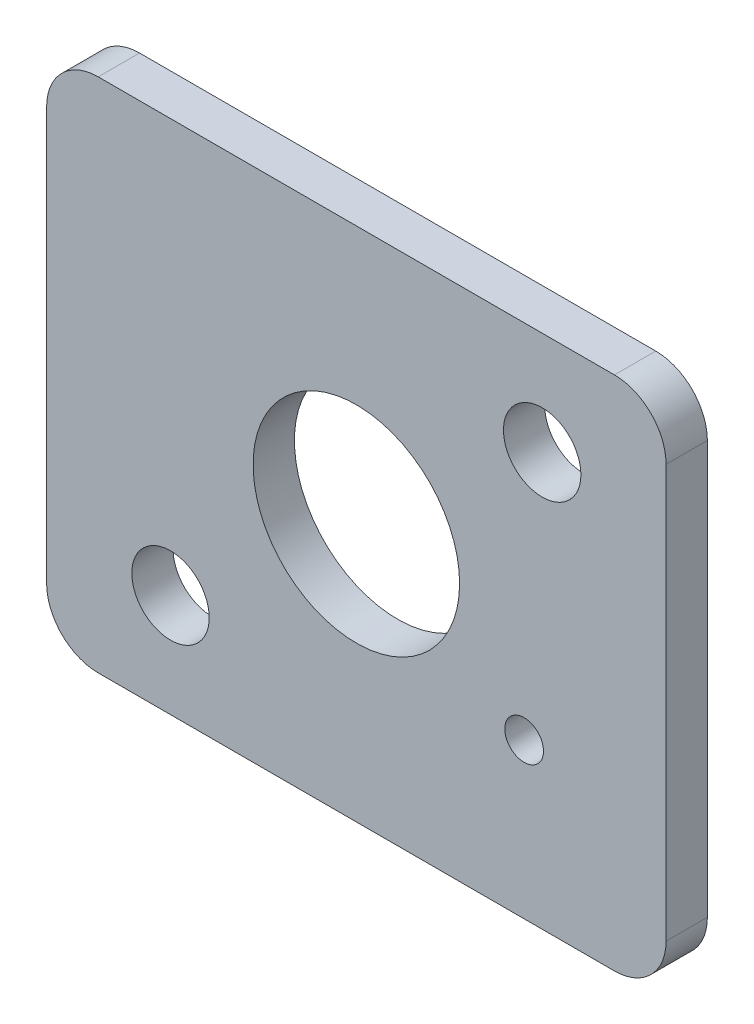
ISO-10303-21;
HEADER;
FILE_DESCRIPTION(('STEP AP214'),'2;1');
FILE_NAME('part.step','',(''),(''),'','','');
FILE_SCHEMA(('AUTOMOTIVE_DESIGN { 1 0 10303 214 1 1 1 1 }'));
ENDSEC;
DATA;
#1=APPLICATION_CONTEXT('core data for automotive mechanical design processes');
#2=APPLICATION_PROTOCOL_DEFINITION('international standard','automotive_design',2000,#1);
#3=PRODUCT_CONTEXT('',#1,'mechanical');
#4=PRODUCT('Part','Part','',(#3));
#5=PRODUCT_RELATED_PRODUCT_CATEGORY('part','',(#4));
#6=PRODUCT_DEFINITION_FORMATION('','',#4);
#7=PRODUCT_DEFINITION_CONTEXT('part definition',#1,'design');
#8=PRODUCT_DEFINITION('design','',#6,#7);
#9=PRODUCT_DEFINITION_SHAPE('','',#8);
#10=(LENGTH_UNIT() NAMED_UNIT(*) SI_UNIT(.MILLI.,.METRE.));
#11=(NAMED_UNIT(*) PLANE_ANGLE_UNIT() SI_UNIT($,.RADIAN.));
#12=(NAMED_UNIT(*) SI_UNIT($,.STERADIAN.) SOLID_ANGLE_UNIT());
#13=UNCERTAINTY_MEASURE_WITH_UNIT(LENGTH_MEASURE(1.E-05),#10,'distance_accuracy_value','');
#14=(GEOMETRIC_REPRESENTATION_CONTEXT(3) GLOBAL_UNCERTAINTY_ASSIGNED_CONTEXT((#13)) GLOBAL_UNIT_ASSIGNED_CONTEXT((#10,
#11,#12)) REPRESENTATION_CONTEXT('',''));
#15=CARTESIAN_POINT('',(0.,0.,0.));
#16=DIRECTION('',(0.,0.,1.));
#17=DIRECTION('',(1.,0.,0.));
#18=AXIS2_PLACEMENT_3D('',#15,#16,#17);
#19=CARTESIAN_POINT('',(6.,-5.,0.8));
#20=DIRECTION('',(-1.,0.,0.));
#21=DIRECTION('',(0.,0.,1.));
#22=AXIS2_PLACEMENT_3D('',#19,#20,#21);
#23=PLANE('',#22);
#24=DIRECTION('',(0.,1.,0.));
#25=VECTOR('',#24,1.);
#26=CARTESIAN_POINT('',(6.,-5.,0.8));
#27=LINE('',#26,#25);
#28=CARTESIAN_POINT('',(6.,-4.,0.8));
#29=VERTEX_POINT('',#28);
#30=CARTESIAN_POINT('',(6.,4.,0.8));
#31=VERTEX_POINT('',#30);
#32=EDGE_CURVE('E119',#29,#31,#27,.T.);
#33=ORIENTED_EDGE('',*,*,#32,.F.);
#34=DIRECTION('',(0.,0.,-1.));
#35=VECTOR('',#34,1.);
#36=CARTESIAN_POINT('',(6.,-4.,0.8));
#37=LINE('',#36,#35);
#38=CARTESIAN_POINT('',(6.,-4.,0.));
#39=VERTEX_POINT('',#38);
#40=EDGE_CURVE('E104',#29,#39,#37,.T.);
#41=ORIENTED_EDGE('',*,*,#40,.T.);
#42=DIRECTION('',(0.,1.,0.));
#43=VECTOR('',#42,1.);
#44=CARTESIAN_POINT('',(6.,-5.,0.));
#45=LINE('',#44,#43);
#46=CARTESIAN_POINT('',(6.,4.,0.));
#47=VERTEX_POINT('',#46);
#48=EDGE_CURVE('E116',#39,#47,#45,.T.);
#49=ORIENTED_EDGE('',*,*,#48,.T.);
#50=DIRECTION('',(0.,0.,-1.));
#51=VECTOR('',#50,1.);
#52=CARTESIAN_POINT('',(6.,4.,0.8));
#53=LINE('',#52,#51);
#54=EDGE_CURVE('E121',#47,#31,#53,.F.);
#55=ORIENTED_EDGE('',*,*,#54,.T.);
#56=EDGE_LOOP('',(#33,#41,#49,#55));
#57=FACE_BOUND('',#56,.T.);
#58=ADVANCED_FACE('F34',(#57),#23,.F.);
#59=CARTESIAN_POINT('',(-6.,5.,0.8));
#60=DIRECTION('',(0.,-1.,0.));
#61=DIRECTION('',(0.,0.,-1.));
#62=AXIS2_PLACEMENT_3D('',#59,#60,#61);
#63=PLANE('',#62);
#64=DIRECTION('',(-1.,0.,0.));
#65=VECTOR('',#64,1.);
#66=CARTESIAN_POINT('',(-6.,5.,0.));
#67=LINE('',#66,#65);
#68=CARTESIAN_POINT('',(5.,5.,0.));
#69=VERTEX_POINT('',#68);
#70=CARTESIAN_POINT('',(-5.,5.,0.));
#71=VERTEX_POINT('',#70);
#72=EDGE_CURVE('E125',#69,#71,#67,.T.);
#73=ORIENTED_EDGE('',*,*,#72,.T.);
#74=DIRECTION('',(0.,0.,-1.));
#75=VECTOR('',#74,1.);
#76=CARTESIAN_POINT('',(-5.,5.,0.8));
#77=LINE('',#76,#75);
#78=CARTESIAN_POINT('',(-5.,5.,0.8));
#79=VERTEX_POINT('',#78);
#80=EDGE_CURVE('E11',#71,#79,#77,.F.);
#81=ORIENTED_EDGE('',*,*,#80,.T.);
#82=DIRECTION('',(-1.,0.,0.));
#83=VECTOR('',#82,1.);
#84=CARTESIAN_POINT('',(-6.,5.,0.8));
#85=LINE('',#84,#83);
#86=CARTESIAN_POINT('',(5.,5.,0.8));
#87=VERTEX_POINT('',#86);
#88=EDGE_CURVE('E165',#87,#79,#85,.T.);
#89=ORIENTED_EDGE('',*,*,#88,.F.);
#90=DIRECTION('',(0.,0.,-1.));
#91=VECTOR('',#90,1.);
#92=CARTESIAN_POINT('',(5.,5.,0.8));
#93=LINE('',#92,#91);
#94=EDGE_CURVE('E42',#87,#69,#93,.T.);
#95=ORIENTED_EDGE('',*,*,#94,.T.);
#96=EDGE_LOOP('',(#73,#81,#89,#95));
#97=FACE_BOUND('',#96,.T.);
#98=ADVANCED_FACE('F163',(#97),#63,.F.);
#99=CARTESIAN_POINT('',(-6.,-5.,0.8));
#100=DIRECTION('',(1.,0.,0.));
#101=DIRECTION('',(0.,0.,-1.));
#102=AXIS2_PLACEMENT_3D('',#99,#100,#101);
#103=PLANE('',#102);
#104=DIRECTION('',(0.,-1.,0.));
#105=VECTOR('',#104,1.);
#106=CARTESIAN_POINT('',(-6.,-5.,0.));
#107=LINE('',#106,#105);
#108=CARTESIAN_POINT('',(-6.,4.,0.));
#109=VERTEX_POINT('',#108);
#110=CARTESIAN_POINT('',(-6.,-4.,0.));
#111=VERTEX_POINT('',#110);
#112=EDGE_CURVE('E129',#109,#111,#107,.T.);
#113=ORIENTED_EDGE('',*,*,#112,.T.);
#114=DIRECTION('',(0.,0.,-1.));
#115=VECTOR('',#114,1.);
#116=CARTESIAN_POINT('',(-6.,-4.,0.8));
#117=LINE('',#116,#115);
#118=CARTESIAN_POINT('',(-6.,-4.,0.8));
#119=VERTEX_POINT('',#118);
#120=EDGE_CURVE('E49',#111,#119,#117,.F.);
#121=ORIENTED_EDGE('',*,*,#120,.T.);
#122=DIRECTION('',(0.,-1.,0.));
#123=VECTOR('',#122,1.);
#124=CARTESIAN_POINT('',(-6.,-5.,0.8));
#125=LINE('',#124,#123);
#126=CARTESIAN_POINT('',(-6.,4.,0.8));
#127=VERTEX_POINT('',#126);
#128=EDGE_CURVE('E173',#127,#119,#125,.T.);
#129=ORIENTED_EDGE('',*,*,#128,.F.);
#130=DIRECTION('',(0.,0.,-1.));
#131=VECTOR('',#130,1.);
#132=CARTESIAN_POINT('',(-6.,4.,0.8));
#133=LINE('',#132,#131);
#134=EDGE_CURVE('E156',#127,#109,#133,.T.);
#135=ORIENTED_EDGE('',*,*,#134,.T.);
#136=EDGE_LOOP('',(#113,#121,#129,#135));
#137=FACE_BOUND('',#136,.T.);
#138=ADVANCED_FACE('F172',(#137),#103,.F.);
#139=CARTESIAN_POINT('',(-6.,-5.,0.8));
#140=DIRECTION('',(0.,1.,0.));
#141=DIRECTION('',(0.,0.,1.));
#142=AXIS2_PLACEMENT_3D('',#139,#140,#141);
#143=PLANE('',#142);
#144=DIRECTION('',(1.,0.,0.));
#145=VECTOR('',#144,1.);
#146=CARTESIAN_POINT('',(-6.,-5.,0.));
#147=LINE('',#146,#145);
#148=CARTESIAN_POINT('',(-5.,-5.,0.));
#149=VERTEX_POINT('',#148);
#150=CARTESIAN_POINT('',(5.,-5.,0.));
#151=VERTEX_POINT('',#150);
#152=EDGE_CURVE('E139',#149,#151,#147,.T.);
#153=ORIENTED_EDGE('',*,*,#152,.T.);
#154=DIRECTION('',(0.,0.,-1.));
#155=VECTOR('',#154,1.);
#156=CARTESIAN_POINT('',(5.,-5.,0.8));
#157=LINE('',#156,#155);
#158=CARTESIAN_POINT('',(5.,-5.,0.8));
#159=VERTEX_POINT('',#158);
#160=EDGE_CURVE('E105',#151,#159,#157,.F.);
#161=ORIENTED_EDGE('',*,*,#160,.T.);
#162=DIRECTION('',(1.,0.,0.));
#163=VECTOR('',#162,1.);
#164=CARTESIAN_POINT('',(-6.,-5.,0.8));
#165=LINE('',#164,#163);
#166=CARTESIAN_POINT('',(-5.,-5.,0.8));
#167=VERTEX_POINT('',#166);
#168=EDGE_CURVE('E135',#167,#159,#165,.T.);
#169=ORIENTED_EDGE('',*,*,#168,.F.);
#170=DIRECTION('',(0.,0.,-1.));
#171=VECTOR('',#170,1.);
#172=CARTESIAN_POINT('',(-5.,-5.,0.8));
#173=LINE('',#172,#171);
#174=EDGE_CURVE('E110',#167,#149,#173,.T.);
#175=ORIENTED_EDGE('',*,*,#174,.T.);
#176=EDGE_LOOP('',(#153,#161,#169,#175));
#177=FACE_BOUND('',#176,.T.);
#178=ADVANCED_FACE('F205',(#177),#143,.F.);
#179=CARTESIAN_POINT('',(0.,0.,0.8));
#180=DIRECTION('',(0.,0.,-1.));
#181=DIRECTION('',(-1.,0.,0.));
#182=AXIS2_PLACEMENT_3D('',#179,#180,#181);
#183=PLANE('',#182);
#184=CARTESIAN_POINT('',(-3.6,-3.,0.8));
#185=DIRECTION('',(0.,0.,1.));
#186=DIRECTION('',(1.,0.,0.));
#187=AXIS2_PLACEMENT_3D('',#184,#185,#186);
#188=CIRCLE('',#187,0.75);
#189=CARTESIAN_POINT('',(-2.84999999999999,-3.,0.8));
#190=VERTEX_POINT('',#189);
#191=EDGE_CURVE('E180',#190,#190,#188,.T.);
#192=ORIENTED_EDGE('',*,*,#191,.F.);
#193=EDGE_LOOP('',(#192));
#194=FACE_BOUND('',#193,.T.);
#195=CARTESIAN_POINT('',(3.6,3.,0.8));
#196=DIRECTION('',(0.,0.,1.));
#197=DIRECTION('',(1.,0.,0.));
#198=AXIS2_PLACEMENT_3D('',#195,#196,#197);
#199=CIRCLE('',#198,0.750000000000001);
#200=CARTESIAN_POINT('',(4.35,3.,0.8));
#201=VERTEX_POINT('',#200);
#202=EDGE_CURVE('E191',#201,#201,#199,.T.);
#203=ORIENTED_EDGE('',*,*,#202,.F.);
#204=EDGE_LOOP('',(#203));
#205=FACE_BOUND('',#204,.T.);
#206=CARTESIAN_POINT('',(3.25,-2.,0.8));
#207=DIRECTION('',(0.,0.,1.));
#208=DIRECTION('',(1.,0.,0.));
#209=AXIS2_PLACEMENT_3D('',#206,#207,#208);
#210=CIRCLE('',#209,0.375);
#211=CARTESIAN_POINT('',(3.625,-2.,0.8));
#212=VERTEX_POINT('',#211);
#213=EDGE_CURVE('E185',#212,#212,#210,.T.);
#214=ORIENTED_EDGE('',*,*,#213,.F.);
#215=EDGE_LOOP('',(#214));
#216=FACE_BOUND('',#215,.T.);
#217=CARTESIAN_POINT('',(0.,0.,0.8));
#218=DIRECTION('',(0.,0.,1.));
#219=DIRECTION('',(1.,0.,0.));
#220=AXIS2_PLACEMENT_3D('',#217,#218,#219);
#221=CIRCLE('',#220,2.);
#222=CARTESIAN_POINT('',(2.,0.,0.8));
#223=VERTEX_POINT('',#222);
#224=EDGE_CURVE('E126',#223,#223,#221,.T.);
#225=ORIENTED_EDGE('',*,*,#224,.F.);
#226=EDGE_LOOP('',(#225));
#227=FACE_BOUND('',#226,.T.);
#228=ORIENTED_EDGE('',*,*,#168,.T.);
#229=CARTESIAN_POINT('',(5.,-4.,0.8));
#230=DIRECTION('',(0.,0.,-1.));
#231=DIRECTION('',(-1.,0.,0.));
#232=AXIS2_PLACEMENT_3D('',#229,#230,#231);
#233=CIRCLE('',#232,1.);
#234=EDGE_CURVE('E154',#159,#29,#233,.F.);
#235=ORIENTED_EDGE('',*,*,#234,.T.);
#236=ORIENTED_EDGE('',*,*,#32,.T.);
#237=CARTESIAN_POINT('',(5.,4.,0.8));
#238=DIRECTION('',(0.,0.,-1.));
#239=DIRECTION('',(-1.,0.,0.));
#240=AXIS2_PLACEMENT_3D('',#237,#238,#239);
#241=CIRCLE('',#240,1.);
#242=EDGE_CURVE('E149',#31,#87,#241,.F.);
#243=ORIENTED_EDGE('',*,*,#242,.T.);
#244=ORIENTED_EDGE('',*,*,#88,.T.);
#245=CARTESIAN_POINT('',(-5.,4.,0.8));
#246=DIRECTION('',(0.,0.,-1.));
#247=DIRECTION('',(-1.,0.,0.));
#248=AXIS2_PLACEMENT_3D('',#245,#246,#247);
#249=CIRCLE('',#248,1.);
#250=EDGE_CURVE('E56',#79,#127,#249,.F.);
#251=ORIENTED_EDGE('',*,*,#250,.T.);
#252=ORIENTED_EDGE('',*,*,#128,.T.);
#253=CARTESIAN_POINT('',(-5.,-4.,0.8));
#254=DIRECTION('',(0.,0.,-1.));
#255=DIRECTION('',(-1.,0.,0.));
#256=AXIS2_PLACEMENT_3D('',#253,#254,#255);
#257=CIRCLE('',#256,1.);
#258=EDGE_CURVE('E152',#119,#167,#257,.F.);
#259=ORIENTED_EDGE('',*,*,#258,.T.);
#260=EDGE_LOOP('',(#228,#235,#236,#243,#244,#251,#252,#259));
#261=FACE_BOUND('',#260,.T.);
#262=ADVANCED_FACE('F202',(#194,#205,#216,#227,#261),#183,.F.);
#263=CARTESIAN_POINT('',(0.,0.,0.));
#264=DIRECTION('',(0.,0.,-1.));
#265=DIRECTION('',(-1.,0.,0.));
#266=AXIS2_PLACEMENT_3D('',#263,#264,#265);
#267=PLANE('',#266);
#268=CARTESIAN_POINT('',(-3.6,-3.,0.));
#269=DIRECTION('',(0.,0.,-1.));
#270=DIRECTION('',(-1.,0.,0.));
#271=AXIS2_PLACEMENT_3D('',#268,#269,#270);
#272=CIRCLE('',#271,0.75);
#273=CARTESIAN_POINT('',(-2.84999999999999,-3.,0.));
#274=VERTEX_POINT('',#273);
#275=EDGE_CURVE('E194',#274,#274,#272,.F.);
#276=ORIENTED_EDGE('',*,*,#275,.T.);
#277=EDGE_LOOP('',(#276));
#278=FACE_BOUND('',#277,.T.);
#279=CARTESIAN_POINT('',(3.6,3.,0.));
#280=DIRECTION('',(0.,0.,-1.));
#281=DIRECTION('',(-1.,0.,0.));
#282=AXIS2_PLACEMENT_3D('',#279,#280,#281);
#283=CIRCLE('',#282,0.750000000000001);
#284=CARTESIAN_POINT('',(4.35,3.,0.));
#285=VERTEX_POINT('',#284);
#286=EDGE_CURVE('E188',#285,#285,#283,.F.);
#287=ORIENTED_EDGE('',*,*,#286,.T.);
#288=EDGE_LOOP('',(#287));
#289=FACE_BOUND('',#288,.T.);
#290=CARTESIAN_POINT('',(3.25,-2.,0.));
#291=DIRECTION('',(0.,0.,-1.));
#292=DIRECTION('',(-1.,0.,0.));
#293=AXIS2_PLACEMENT_3D('',#290,#291,#292);
#294=CIRCLE('',#293,0.375);
#295=CARTESIAN_POINT('',(2.875,-2.,0.));
#296=VERTEX_POINT('',#295);
#297=EDGE_CURVE('E182',#296,#296,#294,.F.);
#298=ORIENTED_EDGE('',*,*,#297,.T.);
#299=EDGE_LOOP('',(#298));
#300=FACE_BOUND('',#299,.T.);
#301=CARTESIAN_POINT('',(0.,0.,0.));
#302=DIRECTION('',(0.,0.,-1.));
#303=DIRECTION('',(-1.,0.,0.));
#304=AXIS2_PLACEMENT_3D('',#301,#302,#303);
#305=CIRCLE('',#304,2.);
#306=CARTESIAN_POINT('',(2.,0.,0.));
#307=VERTEX_POINT('',#306);
#308=EDGE_CURVE('E132',#307,#307,#305,.F.);
#309=ORIENTED_EDGE('',*,*,#308,.T.);
#310=EDGE_LOOP('',(#309));
#311=FACE_BOUND('',#310,.T.);
#312=ORIENTED_EDGE('',*,*,#48,.F.);
#313=CARTESIAN_POINT('',(5.,-4.,0.));
#314=DIRECTION('',(0.,0.,-1.));
#315=DIRECTION('',(-1.,0.,0.));
#316=AXIS2_PLACEMENT_3D('',#313,#314,#315);
#317=CIRCLE('',#316,1.);
#318=EDGE_CURVE('E100',#39,#151,#317,.T.);
#319=ORIENTED_EDGE('',*,*,#318,.T.);
#320=ORIENTED_EDGE('',*,*,#152,.F.);
#321=CARTESIAN_POINT('',(-5.,-4.,0.));
#322=DIRECTION('',(0.,0.,-1.));
#323=DIRECTION('',(-1.,0.,0.));
#324=AXIS2_PLACEMENT_3D('',#321,#322,#323);
#325=CIRCLE('',#324,1.);
#326=EDGE_CURVE('E111',#149,#111,#325,.T.);
#327=ORIENTED_EDGE('',*,*,#326,.T.);
#328=ORIENTED_EDGE('',*,*,#112,.F.);
#329=CARTESIAN_POINT('',(-5.,4.,0.));
#330=DIRECTION('',(0.,0.,-1.));
#331=DIRECTION('',(-1.,0.,0.));
#332=AXIS2_PLACEMENT_3D('',#329,#330,#331);
#333=CIRCLE('',#332,1.);
#334=EDGE_CURVE('E143',#109,#71,#333,.T.);
#335=ORIENTED_EDGE('',*,*,#334,.T.);
#336=ORIENTED_EDGE('',*,*,#72,.F.);
#337=CARTESIAN_POINT('',(5.,4.,0.));
#338=DIRECTION('',(0.,0.,-1.));
#339=DIRECTION('',(-1.,0.,0.));
#340=AXIS2_PLACEMENT_3D('',#337,#338,#339);
#341=CIRCLE('',#340,1.);
#342=EDGE_CURVE('E120',#69,#47,#341,.T.);
#343=ORIENTED_EDGE('',*,*,#342,.T.);
#344=EDGE_LOOP('',(#312,#319,#320,#327,#328,#335,#336,#343));
#345=FACE_BOUND('',#344,.T.);
#346=ADVANCED_FACE('F123',(#278,#289,#300,#311,#345),#267,.T.);
#347=CARTESIAN_POINT('',(0.,0.,-0.00100000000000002));
#348=DIRECTION('',(0.,0.,1.));
#349=DIRECTION('',(1.,0.,0.));
#350=AXIS2_PLACEMENT_3D('',#347,#348,#349);
#351=CYLINDRICAL_SURFACE('',#350,2.);
#352=CARTESIAN_POINT('',(2.,0.,0.));
#353=CARTESIAN_POINT('',(2.,0.,0.00833333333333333));
#354=CARTESIAN_POINT('',(2.,0.,0.0166666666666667));
#355=CARTESIAN_POINT('',(2.,0.,0.0333333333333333));
#356=CARTESIAN_POINT('',(2.,0.,0.0416666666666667));
#357=CARTESIAN_POINT('',(2.,0.,0.0583333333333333));
#358=CARTESIAN_POINT('',(2.,0.,0.0666666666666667));
#359=CARTESIAN_POINT('',(2.,0.,0.0833333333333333));
#360=CARTESIAN_POINT('',(2.,0.,0.0916666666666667));
#361=CARTESIAN_POINT('',(2.,0.,0.108333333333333));
#362=CARTESIAN_POINT('',(2.,0.,0.116666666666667));
#363=CARTESIAN_POINT('',(2.,0.,0.133333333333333));
#364=CARTESIAN_POINT('',(2.,0.,0.141666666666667));
#365=CARTESIAN_POINT('',(2.,0.,0.158333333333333));
#366=CARTESIAN_POINT('',(2.,0.,0.166666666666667));
#367=CARTESIAN_POINT('',(2.,0.,0.183333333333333));
#368=CARTESIAN_POINT('',(2.,0.,0.191666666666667));
#369=CARTESIAN_POINT('',(2.,0.,0.208333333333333));
#370=CARTESIAN_POINT('',(2.,0.,0.216666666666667));
#371=CARTESIAN_POINT('',(2.,0.,0.233333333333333));
#372=CARTESIAN_POINT('',(2.,0.,0.241666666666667));
#373=CARTESIAN_POINT('',(2.,0.,0.258333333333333));
#374=CARTESIAN_POINT('',(2.,0.,0.266666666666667));
#375=CARTESIAN_POINT('',(2.,0.,0.283333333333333));
#376=CARTESIAN_POINT('',(2.,0.,0.291666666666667));
#377=CARTESIAN_POINT('',(2.,0.,0.308333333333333));
#378=CARTESIAN_POINT('',(2.,0.,0.316666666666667));
#379=CARTESIAN_POINT('',(2.,0.,0.333333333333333));
#380=CARTESIAN_POINT('',(2.,0.,0.341666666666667));
#381=CARTESIAN_POINT('',(2.,0.,0.358333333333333));
#382=CARTESIAN_POINT('',(2.,0.,0.366666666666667));
#383=CARTESIAN_POINT('',(2.,0.,0.383333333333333));
#384=CARTESIAN_POINT('',(2.,0.,0.391666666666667));
#385=CARTESIAN_POINT('',(2.,0.,0.408333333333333));
#386=CARTESIAN_POINT('',(2.,0.,0.416666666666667));
#387=CARTESIAN_POINT('',(2.,0.,0.433333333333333));
#388=CARTESIAN_POINT('',(2.,0.,0.441666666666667));
#389=CARTESIAN_POINT('',(2.,0.,0.458333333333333));
#390=CARTESIAN_POINT('',(2.,0.,0.466666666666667));
#391=CARTESIAN_POINT('',(2.,0.,0.483333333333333));
#392=CARTESIAN_POINT('',(2.,0.,0.491666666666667));
#393=CARTESIAN_POINT('',(2.,0.,0.508333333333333));
#394=CARTESIAN_POINT('',(2.,0.,0.516666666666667));
#395=CARTESIAN_POINT('',(2.,0.,0.533333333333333));
#396=CARTESIAN_POINT('',(2.,0.,0.541666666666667));
#397=CARTESIAN_POINT('',(2.,0.,0.558333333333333));
#398=CARTESIAN_POINT('',(2.,0.,0.566666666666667));
#399=CARTESIAN_POINT('',(2.,0.,0.583333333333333));
#400=CARTESIAN_POINT('',(2.,0.,0.591666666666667));
#401=CARTESIAN_POINT('',(2.,0.,0.608333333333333));
#402=CARTESIAN_POINT('',(2.,0.,0.616666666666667));
#403=CARTESIAN_POINT('',(2.,0.,0.633333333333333));
#404=CARTESIAN_POINT('',(2.,0.,0.641666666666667));
#405=CARTESIAN_POINT('',(2.,0.,0.658333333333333));
#406=CARTESIAN_POINT('',(2.,0.,0.666666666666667));
#407=CARTESIAN_POINT('',(2.,0.,0.683333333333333));
#408=CARTESIAN_POINT('',(2.,0.,0.691666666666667));
#409=CARTESIAN_POINT('',(2.,0.,0.708333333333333));
#410=CARTESIAN_POINT('',(2.,0.,0.716666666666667));
#411=CARTESIAN_POINT('',(2.,0.,0.733333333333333));
#412=CARTESIAN_POINT('',(2.,0.,0.741666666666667));
#413=CARTESIAN_POINT('',(2.,0.,0.758333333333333));
#414=CARTESIAN_POINT('',(2.,0.,0.766666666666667));
#415=CARTESIAN_POINT('',(2.,0.,0.783333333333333));
#416=CARTESIAN_POINT('',(2.,0.,0.791666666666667));
#417=CARTESIAN_POINT('',(2.,0.,0.8));
#418=B_SPLINE_CURVE_WITH_KNOTS('',3,(#352,#353,#354,#355,#356,#357,#358,#359,#360,#361,#362,
#363,#364,#365,#366,#367,#368,#369,#370,#371,#372,#373,#374,#375,#376,#377,#378,#379,#380,#381,
#382,#383,#384,#385,#386,#387,#388,#389,#390,#391,#392,#393,#394,#395,#396,#397,#398,#399,#400,
#401,#402,#403,#404,#405,#406,#407,#408,#409,#410,#411,#412,#413,#414,#415,#416,#417),
.UNSPECIFIED.,.F.,.F.,(4,2,2,2,2,2,2,2,2,2,2,2,2,2,2,2,2,2,2,2,2,2,2,2,2,2,2,2,2,2,2,2,4),(0.,
0.025,0.05,0.075,0.1,0.125,0.15,0.175,0.2,0.225,0.25,0.275,0.3,0.325,0.35,0.375,0.4,0.425,0.45,
0.475,0.5,0.525,0.55,0.575,0.6,0.625,0.65,0.675,0.7,0.725,0.75,0.775,0.8),.UNSPECIFIED.);
#419=EDGE_CURVE('BSEAM236',#307,#223,#418,.T.);
#420=ORIENTED_EDGE('',*,*,#308,.F.);
#421=ORIENTED_EDGE('',*,*,#224,.T.);
#422=ORIENTED_EDGE('',*,*,#419,.T.);
#423=ORIENTED_EDGE('',*,*,#419,.F.);
#424=EDGE_LOOP('',(#420,#422,#421,#423));
#425=FACE_BOUND('',#424,.T.);
#426=ADVANCED_FACE('F236',(#425),#351,.F.);
#427=CARTESIAN_POINT('',(3.25,-2.,-0.00100000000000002));
#428=DIRECTION('',(0.,0.,1.));
#429=DIRECTION('',(1.,0.,0.));
#430=AXIS2_PLACEMENT_3D('',#427,#428,#429);
#431=CYLINDRICAL_SURFACE('',#430,0.375);
#432=ORIENTED_EDGE('',*,*,#297,.F.);
#433=EDGE_LOOP('',(#432));
#434=FACE_BOUND('',#433,.T.);
#435=ORIENTED_EDGE('',*,*,#213,.T.);
#436=EDGE_LOOP('',(#435));
#437=FACE_BOUND('',#436,.T.);
#438=ADVANCED_FACE('F241',(#434,#437),#431,.F.);
#439=CARTESIAN_POINT('',(3.6,3.,-0.00100000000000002));
#440=DIRECTION('',(0.,0.,1.));
#441=DIRECTION('',(1.,0.,0.));
#442=AXIS2_PLACEMENT_3D('',#439,#440,#441);
#443=CYLINDRICAL_SURFACE('',#442,0.750000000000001);
#444=CARTESIAN_POINT('',(4.35,3.,0.));
#445=CARTESIAN_POINT('',(4.35,3.,0.00833333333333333));
#446=CARTESIAN_POINT('',(4.35,3.,0.0166666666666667));
#447=CARTESIAN_POINT('',(4.35,3.,0.0333333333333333));
#448=CARTESIAN_POINT('',(4.35,3.,0.0416666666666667));
#449=CARTESIAN_POINT('',(4.35,3.,0.0583333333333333));
#450=CARTESIAN_POINT('',(4.35,3.,0.0666666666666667));
#451=CARTESIAN_POINT('',(4.35,3.,0.0833333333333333));
#452=CARTESIAN_POINT('',(4.35,3.,0.0916666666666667));
#453=CARTESIAN_POINT('',(4.35,3.,0.108333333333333));
#454=CARTESIAN_POINT('',(4.35,3.,0.116666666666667));
#455=CARTESIAN_POINT('',(4.35,3.,0.133333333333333));
#456=CARTESIAN_POINT('',(4.35,3.,0.141666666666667));
#457=CARTESIAN_POINT('',(4.35,3.,0.158333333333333));
#458=CARTESIAN_POINT('',(4.35,3.,0.166666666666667));
#459=CARTESIAN_POINT('',(4.35,3.,0.183333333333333));
#460=CARTESIAN_POINT('',(4.35,3.,0.191666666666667));
#461=CARTESIAN_POINT('',(4.35,3.,0.208333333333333));
#462=CARTESIAN_POINT('',(4.35,3.,0.216666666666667));
#463=CARTESIAN_POINT('',(4.35,3.,0.233333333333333));
#464=CARTESIAN_POINT('',(4.35,3.,0.241666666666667));
#465=CARTESIAN_POINT('',(4.35,3.,0.258333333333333));
#466=CARTESIAN_POINT('',(4.35,3.,0.266666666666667));
#467=CARTESIAN_POINT('',(4.35,3.,0.283333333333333));
#468=CARTESIAN_POINT('',(4.35,3.,0.291666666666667));
#469=CARTESIAN_POINT('',(4.35,3.,0.308333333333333));
#470=CARTESIAN_POINT('',(4.35,3.,0.316666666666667));
#471=CARTESIAN_POINT('',(4.35,3.,0.333333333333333));
#472=CARTESIAN_POINT('',(4.35,3.,0.341666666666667));
#473=CARTESIAN_POINT('',(4.35,3.,0.358333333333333));
#474=CARTESIAN_POINT('',(4.35,3.,0.366666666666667));
#475=CARTESIAN_POINT('',(4.35,3.,0.383333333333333));
#476=CARTESIAN_POINT('',(4.35,3.,0.391666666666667));
#477=CARTESIAN_POINT('',(4.35,3.,0.408333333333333));
#478=CARTESIAN_POINT('',(4.35,3.,0.416666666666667));
#479=CARTESIAN_POINT('',(4.35,3.,0.433333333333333));
#480=CARTESIAN_POINT('',(4.35,3.,0.441666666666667));
#481=CARTESIAN_POINT('',(4.35,3.,0.458333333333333));
#482=CARTESIAN_POINT('',(4.35,3.,0.466666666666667));
#483=CARTESIAN_POINT('',(4.35,3.,0.483333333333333));
#484=CARTESIAN_POINT('',(4.35,3.,0.491666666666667));
#485=CARTESIAN_POINT('',(4.35,3.,0.508333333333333));
#486=CARTESIAN_POINT('',(4.35,3.,0.516666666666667));
#487=CARTESIAN_POINT('',(4.35,3.,0.533333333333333));
#488=CARTESIAN_POINT('',(4.35,3.,0.541666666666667));
#489=CARTESIAN_POINT('',(4.35,3.,0.558333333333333));
#490=CARTESIAN_POINT('',(4.35,3.,0.566666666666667));
#491=CARTESIAN_POINT('',(4.35,3.,0.583333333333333));
#492=CARTESIAN_POINT('',(4.35,3.,0.591666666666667));
#493=CARTESIAN_POINT('',(4.35,3.,0.608333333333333));
#494=CARTESIAN_POINT('',(4.35,3.,0.616666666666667));
#495=CARTESIAN_POINT('',(4.35,3.,0.633333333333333));
#496=CARTESIAN_POINT('',(4.35,3.,0.641666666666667));
#497=CARTESIAN_POINT('',(4.35,3.,0.658333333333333));
#498=CARTESIAN_POINT('',(4.35,3.,0.666666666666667));
#499=CARTESIAN_POINT('',(4.35,3.,0.683333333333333));
#500=CARTESIAN_POINT('',(4.35,3.,0.691666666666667));
#501=CARTESIAN_POINT('',(4.35,3.,0.708333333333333));
#502=CARTESIAN_POINT('',(4.35,3.,0.716666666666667));
#503=CARTESIAN_POINT('',(4.35,3.,0.733333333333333));
#504=CARTESIAN_POINT('',(4.35,3.,0.741666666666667));
#505=CARTESIAN_POINT('',(4.35,3.,0.758333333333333));
#506=CARTESIAN_POINT('',(4.35,3.,0.766666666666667));
#507=CARTESIAN_POINT('',(4.35,3.,0.783333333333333));
#508=CARTESIAN_POINT('',(4.35,3.,0.791666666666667));
#509=CARTESIAN_POINT('',(4.35,3.,0.8));
#510=B_SPLINE_CURVE_WITH_KNOTS('',3,(#444,#445,#446,#447,#448,#449,#450,#451,#452,#453,#454,
#455,#456,#457,#458,#459,#460,#461,#462,#463,#464,#465,#466,#467,#468,#469,#470,#471,#472,#473,
#474,#475,#476,#477,#478,#479,#480,#481,#482,#483,#484,#485,#486,#487,#488,#489,#490,#491,#492,
#493,#494,#495,#496,#497,#498,#499,#500,#501,#502,#503,#504,#505,#506,#507,#508,#509),
.UNSPECIFIED.,.F.,.F.,(4,2,2,2,2,2,2,2,2,2,2,2,2,2,2,2,2,2,2,2,2,2,2,2,2,2,2,2,2,2,2,2,4),(0.,
0.025,0.05,0.075,0.1,0.125,0.15,0.175,0.2,0.225,0.25,0.275,0.3,0.325,0.35,0.375,0.4,0.425,0.45,
0.475,0.5,0.525,0.55,0.575,0.6,0.625,0.65,0.675,0.7,0.725,0.75,0.775,0.8),.UNSPECIFIED.);
#511=EDGE_CURVE('BSEAM245',#285,#201,#510,.T.);
#512=ORIENTED_EDGE('',*,*,#286,.F.);
#513=ORIENTED_EDGE('',*,*,#202,.T.);
#514=ORIENTED_EDGE('',*,*,#511,.T.);
#515=ORIENTED_EDGE('',*,*,#511,.F.);
#516=EDGE_LOOP('',(#512,#514,#513,#515));
#517=FACE_BOUND('',#516,.T.);
#518=ADVANCED_FACE('F245',(#517),#443,.F.);
#519=CARTESIAN_POINT('',(-3.6,-3.,-0.00100000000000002));
#520=DIRECTION('',(0.,0.,1.));
#521=DIRECTION('',(1.,0.,0.));
#522=AXIS2_PLACEMENT_3D('',#519,#520,#521);
#523=CYLINDRICAL_SURFACE('',#522,0.75);
#524=CARTESIAN_POINT('',(-2.84999999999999,-3.,0.));
#525=CARTESIAN_POINT('',(-2.84999999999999,-3.,0.00833333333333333));
#526=CARTESIAN_POINT('',(-2.84999999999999,-3.,0.0166666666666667));
#527=CARTESIAN_POINT('',(-2.84999999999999,-3.,0.0333333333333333));
#528=CARTESIAN_POINT('',(-2.84999999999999,-3.,0.0416666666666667));
#529=CARTESIAN_POINT('',(-2.84999999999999,-3.,0.0583333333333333));
#530=CARTESIAN_POINT('',(-2.84999999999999,-3.,0.0666666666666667));
#531=CARTESIAN_POINT('',(-2.84999999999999,-3.,0.0833333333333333));
#532=CARTESIAN_POINT('',(-2.84999999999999,-3.,0.0916666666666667));
#533=CARTESIAN_POINT('',(-2.84999999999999,-3.,0.108333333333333));
#534=CARTESIAN_POINT('',(-2.84999999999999,-3.,0.116666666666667));
#535=CARTESIAN_POINT('',(-2.84999999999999,-3.,0.133333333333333));
#536=CARTESIAN_POINT('',(-2.84999999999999,-3.,0.141666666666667));
#537=CARTESIAN_POINT('',(-2.84999999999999,-3.,0.158333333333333));
#538=CARTESIAN_POINT('',(-2.84999999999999,-3.,0.166666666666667));
#539=CARTESIAN_POINT('',(-2.84999999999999,-3.,0.183333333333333));
#540=CARTESIAN_POINT('',(-2.84999999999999,-3.,0.191666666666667));
#541=CARTESIAN_POINT('',(-2.84999999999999,-3.,0.208333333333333));
#542=CARTESIAN_POINT('',(-2.84999999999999,-3.,0.216666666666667));
#543=CARTESIAN_POINT('',(-2.84999999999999,-3.,0.233333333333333));
#544=CARTESIAN_POINT('',(-2.84999999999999,-3.,0.241666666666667));
#545=CARTESIAN_POINT('',(-2.84999999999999,-3.,0.258333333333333));
#546=CARTESIAN_POINT('',(-2.84999999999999,-3.,0.266666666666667));
#547=CARTESIAN_POINT('',(-2.84999999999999,-3.,0.283333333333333));
#548=CARTESIAN_POINT('',(-2.84999999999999,-3.,0.291666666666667));
#549=CARTESIAN_POINT('',(-2.84999999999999,-3.,0.308333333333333));
#550=CARTESIAN_POINT('',(-2.84999999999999,-3.,0.316666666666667));
#551=CARTESIAN_POINT('',(-2.84999999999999,-3.,0.333333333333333));
#552=CARTESIAN_POINT('',(-2.84999999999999,-3.,0.341666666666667));
#553=CARTESIAN_POINT('',(-2.84999999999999,-3.,0.358333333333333));
#554=CARTESIAN_POINT('',(-2.84999999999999,-3.,0.366666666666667));
#555=CARTESIAN_POINT('',(-2.84999999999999,-3.,0.383333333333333));
#556=CARTESIAN_POINT('',(-2.84999999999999,-3.,0.391666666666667));
#557=CARTESIAN_POINT('',(-2.84999999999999,-3.,0.408333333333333));
#558=CARTESIAN_POINT('',(-2.84999999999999,-3.,0.416666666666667));
#559=CARTESIAN_POINT('',(-2.84999999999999,-3.,0.433333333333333));
#560=CARTESIAN_POINT('',(-2.84999999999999,-3.,0.441666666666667));
#561=CARTESIAN_POINT('',(-2.84999999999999,-3.,0.458333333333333));
#562=CARTESIAN_POINT('',(-2.84999999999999,-3.,0.466666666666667));
#563=CARTESIAN_POINT('',(-2.84999999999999,-3.,0.483333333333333));
#564=CARTESIAN_POINT('',(-2.84999999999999,-3.,0.491666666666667));
#565=CARTESIAN_POINT('',(-2.84999999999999,-3.,0.508333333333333));
#566=CARTESIAN_POINT('',(-2.84999999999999,-3.,0.516666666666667));
#567=CARTESIAN_POINT('',(-2.84999999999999,-3.,0.533333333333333));
#568=CARTESIAN_POINT('',(-2.84999999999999,-3.,0.541666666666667));
#569=CARTESIAN_POINT('',(-2.84999999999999,-3.,0.558333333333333));
#570=CARTESIAN_POINT('',(-2.84999999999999,-3.,0.566666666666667));
#571=CARTESIAN_POINT('',(-2.84999999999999,-3.,0.583333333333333));
#572=CARTESIAN_POINT('',(-2.84999999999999,-3.,0.591666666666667));
#573=CARTESIAN_POINT('',(-2.84999999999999,-3.,0.608333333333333));
#574=CARTESIAN_POINT('',(-2.84999999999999,-3.,0.616666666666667));
#575=CARTESIAN_POINT('',(-2.84999999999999,-3.,0.633333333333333));
#576=CARTESIAN_POINT('',(-2.84999999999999,-3.,0.641666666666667));
#577=CARTESIAN_POINT('',(-2.84999999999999,-3.,0.658333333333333));
#578=CARTESIAN_POINT('',(-2.84999999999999,-3.,0.666666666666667));
#579=CARTESIAN_POINT('',(-2.84999999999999,-3.,0.683333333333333));
#580=CARTESIAN_POINT('',(-2.84999999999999,-3.,0.691666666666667));
#581=CARTESIAN_POINT('',(-2.84999999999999,-3.,0.708333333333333));
#582=CARTESIAN_POINT('',(-2.84999999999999,-3.,0.716666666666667));
#583=CARTESIAN_POINT('',(-2.84999999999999,-3.,0.733333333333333));
#584=CARTESIAN_POINT('',(-2.84999999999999,-3.,0.741666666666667));
#585=CARTESIAN_POINT('',(-2.84999999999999,-3.,0.758333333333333));
#586=CARTESIAN_POINT('',(-2.84999999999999,-3.,0.766666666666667));
#587=CARTESIAN_POINT('',(-2.84999999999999,-3.,0.783333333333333));
#588=CARTESIAN_POINT('',(-2.84999999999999,-3.,0.791666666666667));
#589=CARTESIAN_POINT('',(-2.84999999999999,-3.,0.8));
#590=B_SPLINE_CURVE_WITH_KNOTS('',3,(#524,#525,#526,#527,#528,#529,#530,#531,#532,#533,#534,
#535,#536,#537,#538,#539,#540,#541,#542,#543,#544,#545,#546,#547,#548,#549,#550,#551,#552,#553,
#554,#555,#556,#557,#558,#559,#560,#561,#562,#563,#564,#565,#566,#567,#568,#569,#570,#571,#572,
#573,#574,#575,#576,#577,#578,#579,#580,#581,#582,#583,#584,#585,#586,#587,#588,#589),
.UNSPECIFIED.,.F.,.F.,(4,2,2,2,2,2,2,2,2,2,2,2,2,2,2,2,2,2,2,2,2,2,2,2,2,2,2,2,2,2,2,2,4),(0.,
0.025,0.05,0.075,0.1,0.125,0.15,0.175,0.2,0.225,0.25,0.275,0.3,0.325,0.35,0.375,0.4,0.425,0.45,
0.475,0.5,0.525,0.55,0.575,0.6,0.625,0.65,0.675,0.7,0.725,0.75,0.775,0.8),.UNSPECIFIED.);
#591=EDGE_CURVE('BSEAM200',#274,#190,#590,.T.);
#592=ORIENTED_EDGE('',*,*,#275,.F.);
#593=ORIENTED_EDGE('',*,*,#191,.T.);
#594=ORIENTED_EDGE('',*,*,#591,.T.);
#595=ORIENTED_EDGE('',*,*,#591,.F.);
#596=EDGE_LOOP('',(#592,#594,#593,#595));
#597=FACE_BOUND('',#596,.T.);
#598=ADVANCED_FACE('F200',(#597),#523,.F.);
#599=CARTESIAN_POINT('',(5.,-4.,0.8));
#600=DIRECTION('',(0.,0.,-1.));
#601=DIRECTION('',(-1.,0.,0.));
#602=AXIS2_PLACEMENT_3D('',#599,#600,#601);
#603=CYLINDRICAL_SURFACE('',#602,1.);
#604=ORIENTED_EDGE('',*,*,#234,.F.);
#605=ORIENTED_EDGE('',*,*,#160,.F.);
#606=ORIENTED_EDGE('',*,*,#318,.F.);
#607=ORIENTED_EDGE('',*,*,#40,.F.);
#608=EDGE_LOOP('',(#604,#605,#606,#607));
#609=FACE_BOUND('',#608,.T.);
#610=ADVANCED_FACE('F103',(#609),#603,.T.);
#611=CARTESIAN_POINT('',(-5.,-4.,0.8));
#612=DIRECTION('',(0.,0.,-1.));
#613=DIRECTION('',(-1.,0.,0.));
#614=AXIS2_PLACEMENT_3D('',#611,#612,#613);
#615=CYLINDRICAL_SURFACE('',#614,1.);
#616=ORIENTED_EDGE('',*,*,#258,.F.);
#617=ORIENTED_EDGE('',*,*,#120,.F.);
#618=ORIENTED_EDGE('',*,*,#326,.F.);
#619=ORIENTED_EDGE('',*,*,#174,.F.);
#620=EDGE_LOOP('',(#616,#617,#618,#619));
#621=FACE_BOUND('',#620,.T.);
#622=ADVANCED_FACE('F216',(#621),#615,.T.);
#623=CARTESIAN_POINT('',(-5.,4.,0.8));
#624=DIRECTION('',(0.,0.,-1.));
#625=DIRECTION('',(-1.,0.,0.));
#626=AXIS2_PLACEMENT_3D('',#623,#624,#625);
#627=CYLINDRICAL_SURFACE('',#626,1.);
#628=ORIENTED_EDGE('',*,*,#250,.F.);
#629=ORIENTED_EDGE('',*,*,#80,.F.);
#630=ORIENTED_EDGE('',*,*,#334,.F.);
#631=ORIENTED_EDGE('',*,*,#134,.F.);
#632=EDGE_LOOP('',(#628,#629,#630,#631));
#633=FACE_BOUND('',#632,.T.);
#634=ADVANCED_FACE('F171',(#633),#627,.T.);
#635=CARTESIAN_POINT('',(5.,4.,0.8));
#636=DIRECTION('',(0.,0.,-1.));
#637=DIRECTION('',(-1.,0.,0.));
#638=AXIS2_PLACEMENT_3D('',#635,#636,#637);
#639=CYLINDRICAL_SURFACE('',#638,1.);
#640=ORIENTED_EDGE('',*,*,#242,.F.);
#641=ORIENTED_EDGE('',*,*,#54,.F.);
#642=ORIENTED_EDGE('',*,*,#342,.F.);
#643=ORIENTED_EDGE('',*,*,#94,.F.);
#644=EDGE_LOOP('',(#640,#641,#642,#643));
#645=FACE_BOUND('',#644,.T.);
#646=ADVANCED_FACE('F36',(#645),#639,.T.);
#647=CLOSED_SHELL('',(#58,#98,#138,#178,#262,#346,#426,#438,#518,#598,#610,#622,#634,#646));
#648=MANIFOLD_SOLID_BREP('B2',#647);
#649=ADVANCED_BREP_SHAPE_REPRESENTATION('',(#18,#648),#14);
#650=SHAPE_DEFINITION_REPRESENTATION(#9,#649);
ENDSEC;
END-ISO-10303-21;
